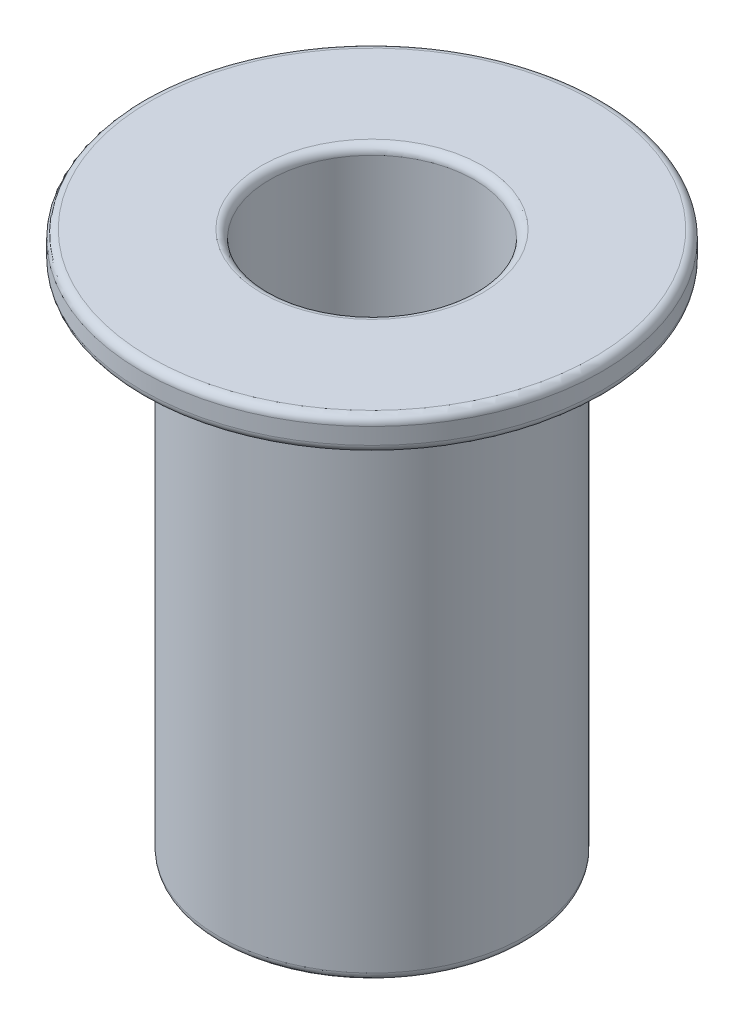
ISO-10303-21;
HEADER;
FILE_DESCRIPTION(('STEP AP214'),'2;1');
FILE_NAME('part.step','',(''),(''),'','','');
FILE_SCHEMA(('AUTOMOTIVE_DESIGN { 1 0 10303 214 1 1 1 1 }'));
ENDSEC;
DATA;
#1=APPLICATION_CONTEXT('core data for automotive mechanical design processes');
#2=APPLICATION_PROTOCOL_DEFINITION('international standard','automotive_design',2000,#1);
#3=PRODUCT_CONTEXT('',#1,'mechanical');
#4=PRODUCT('Part','Part','',(#3));
#5=PRODUCT_RELATED_PRODUCT_CATEGORY('part','',(#4));
#6=PRODUCT_DEFINITION_FORMATION('','',#4);
#7=PRODUCT_DEFINITION_CONTEXT('part definition',#1,'design');
#8=PRODUCT_DEFINITION('design','',#6,#7);
#9=PRODUCT_DEFINITION_SHAPE('','',#8);
#10=(LENGTH_UNIT() NAMED_UNIT(*) SI_UNIT(.MILLI.,.METRE.));
#11=(NAMED_UNIT(*) PLANE_ANGLE_UNIT() SI_UNIT($,.RADIAN.));
#12=(NAMED_UNIT(*) SI_UNIT($,.STERADIAN.) SOLID_ANGLE_UNIT());
#13=UNCERTAINTY_MEASURE_WITH_UNIT(LENGTH_MEASURE(1.E-05),#10,'distance_accuracy_value','');
#14=(GEOMETRIC_REPRESENTATION_CONTEXT(3) GLOBAL_UNCERTAINTY_ASSIGNED_CONTEXT((#13)) GLOBAL_UNIT_ASSIGNED_CONTEXT((#10,
#11,#12)) REPRESENTATION_CONTEXT('',''));
#15=CARTESIAN_POINT('',(0.,0.,0.));
#16=DIRECTION('',(0.,0.,1.));
#17=DIRECTION('',(1.,0.,0.));
#18=AXIS2_PLACEMENT_3D('',#15,#16,#17);
#19=CARTESIAN_POINT('',(0.,-15.875,0.));
#20=DIRECTION('',(0.,-1.,0.));
#21=DIRECTION('',(0.,0.,-1.));
#22=AXIS2_PLACEMENT_3D('',#19,#20,#21);
#23=PLANE('',#22);
#24=CARTESIAN_POINT('',(0.,-15.875,0.));
#25=DIRECTION('',(0.,-1.,0.));
#26=DIRECTION('',(0.,0.,-1.));
#27=AXIS2_PLACEMENT_3D('',#24,#25,#26);
#28=CIRCLE('',#27,4.5085);
#29=CARTESIAN_POINT('',(0.,-15.875,-4.5085));
#30=VERTEX_POINT('',#29);
#31=EDGE_CURVE('E53',#30,#30,#28,.T.);
#32=ORIENTED_EDGE('',*,*,#31,.T.);
#33=EDGE_LOOP('',(#32));
#34=FACE_BOUND('',#33,.T.);
#35=CARTESIAN_POINT('',(0.,-15.875,0.));
#36=DIRECTION('',(0.,-1.,0.));
#37=DIRECTION('',(0.,0.,-1.));
#38=AXIS2_PLACEMENT_3D('',#35,#36,#37);
#39=CIRCLE('',#38,2.41299999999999);
#40=CARTESIAN_POINT('',(0.,-15.875,-2.41299999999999));
#41=VERTEX_POINT('',#40);
#42=EDGE_CURVE('E69',#41,#41,#39,.T.);
#43=ORIENTED_EDGE('',*,*,#42,.F.);
#44=EDGE_LOOP('',(#43));
#45=FACE_BOUND('',#44,.T.);
#46=ADVANCED_FACE('F30',(#34,#45),#23,.T.);
#47=CARTESIAN_POINT('',(0.,0.,0.));
#48=DIRECTION('',(0.,1.,0.));
#49=DIRECTION('',(0.,0.,1.));
#50=AXIS2_PLACEMENT_3D('',#47,#48,#49);
#51=PLANE('',#50);
#52=CARTESIAN_POINT('',(0.,0.,0.));
#53=DIRECTION('',(0.,1.,0.));
#54=DIRECTION('',(0.,0.,1.));
#55=AXIS2_PLACEMENT_3D('',#52,#53,#54);
#56=CIRCLE('',#55,5.0165);
#57=CARTESIAN_POINT('',(0.,0.,5.0165));
#58=VERTEX_POINT('',#57);
#59=EDGE_CURVE('E56',#58,#58,#56,.T.);
#60=ORIENTED_EDGE('',*,*,#59,.T.);
#61=EDGE_LOOP('',(#60));
#62=FACE_BOUND('',#61,.T.);
#63=CARTESIAN_POINT('',(0.,0.,0.));
#64=DIRECTION('',(0.,1.,0.));
#65=DIRECTION('',(0.,0.,1.));
#66=AXIS2_PLACEMENT_3D('',#63,#64,#65);
#67=CIRCLE('',#66,6.88975);
#68=CARTESIAN_POINT('',(0.,0.,6.88975));
#69=VERTEX_POINT('',#68);
#70=EDGE_CURVE('E59',#69,#69,#67,.F.);
#71=ORIENTED_EDGE('',*,*,#70,.T.);
#72=EDGE_LOOP('',(#71));
#73=FACE_BOUND('',#72,.T.);
#74=ADVANCED_FACE('F98',(#62,#73),#51,.F.);
#75=CARTESIAN_POINT('',(0.,1.016,0.));
#76=DIRECTION('',(0.,-1.,0.));
#77=DIRECTION('',(0.,0.,-1.));
#78=AXIS2_PLACEMENT_3D('',#75,#76,#77);
#79=CYLINDRICAL_SURFACE('',#78,7.14375);
#80=CARTESIAN_POINT('',(0.,0.254,0.));
#81=DIRECTION('',(0.,1.,0.));
#82=DIRECTION('',(0.,0.,1.));
#83=AXIS2_PLACEMENT_3D('',#80,#81,#82);
#84=CIRCLE('',#83,7.14375);
#85=CARTESIAN_POINT('',(0.,0.254,7.14375));
#86=VERTEX_POINT('',#85);
#87=EDGE_CURVE('E45',#86,#86,#84,.T.);
#88=ORIENTED_EDGE('',*,*,#87,.T.);
#89=EDGE_LOOP('',(#88));
#90=FACE_BOUND('',#89,.T.);
#91=CARTESIAN_POINT('',(0.,0.762,0.));
#92=DIRECTION('',(0.,1.,0.));
#93=DIRECTION('',(0.,0.,1.));
#94=AXIS2_PLACEMENT_3D('',#91,#92,#93);
#95=CIRCLE('',#94,7.14375);
#96=CARTESIAN_POINT('',(0.,0.762,7.14375));
#97=VERTEX_POINT('',#96);
#98=EDGE_CURVE('E50',#97,#97,#95,.F.);
#99=ORIENTED_EDGE('',*,*,#98,.T.);
#100=EDGE_LOOP('',(#99));
#101=FACE_BOUND('',#100,.T.);
#102=ADVANCED_FACE('F32',(#90,#101),#79,.T.);
#103=CARTESIAN_POINT('',(0.,1.016,0.));
#104=DIRECTION('',(0.,1.,0.));
#105=DIRECTION('',(0.,0.,1.));
#106=AXIS2_PLACEMENT_3D('',#103,#104,#105);
#107=PLANE('',#106);
#108=CARTESIAN_POINT('',(0.,1.016,0.));
#109=DIRECTION('',(0.,1.,0.));
#110=DIRECTION('',(0.,0.,1.));
#111=AXIS2_PLACEMENT_3D('',#108,#109,#110);
#112=CIRCLE('',#111,6.88975);
#113=CARTESIAN_POINT('',(0.,1.016,6.88975));
#114=VERTEX_POINT('',#113);
#115=EDGE_CURVE('E37',#114,#114,#112,.T.);
#116=ORIENTED_EDGE('',*,*,#115,.T.);
#117=EDGE_LOOP('',(#116));
#118=FACE_BOUND('',#117,.T.);
#119=CARTESIAN_POINT('',(0.,1.016,0.));
#120=DIRECTION('',(0.,1.,0.));
#121=DIRECTION('',(0.,0.,1.));
#122=AXIS2_PLACEMENT_3D('',#119,#120,#121);
#123=CIRCLE('',#122,3.429);
#124=CARTESIAN_POINT('',(0.,1.016,3.429));
#125=VERTEX_POINT('',#124);
#126=EDGE_CURVE('E41',#125,#125,#123,.F.);
#127=ORIENTED_EDGE('',*,*,#126,.T.);
#128=EDGE_LOOP('',(#127));
#129=FACE_BOUND('',#128,.T.);
#130=ADVANCED_FACE('F93',(#118,#129),#107,.T.);
#131=CARTESIAN_POINT('',(0.,-15.875,0.));
#132=DIRECTION('',(0.,1.,0.));
#133=DIRECTION('',(0.,0.,1.));
#134=AXIS2_PLACEMENT_3D('',#131,#132,#133);
#135=CYLINDRICAL_SURFACE('',#134,4.7625);
#136=CARTESIAN_POINT('',(0.,-0.254000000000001,0.));
#137=DIRECTION('',(0.,1.,0.));
#138=DIRECTION('',(0.,0.,1.));
#139=AXIS2_PLACEMENT_3D('',#136,#137,#138);
#140=CIRCLE('',#139,4.7625);
#141=CARTESIAN_POINT('',(0.,-0.254000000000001,4.7625));
#142=VERTEX_POINT('',#141);
#143=EDGE_CURVE('E62',#142,#142,#140,.F.);
#144=ORIENTED_EDGE('',*,*,#143,.T.);
#145=EDGE_LOOP('',(#144));
#146=FACE_BOUND('',#145,.T.);
#147=CARTESIAN_POINT('',(0.,-15.621,0.));
#148=DIRECTION('',(0.,-1.,0.));
#149=DIRECTION('',(0.,0.,-1.));
#150=AXIS2_PLACEMENT_3D('',#147,#148,#149);
#151=CIRCLE('',#150,4.7625);
#152=CARTESIAN_POINT('',(0.,-15.621,-4.7625));
#153=VERTEX_POINT('',#152);
#154=EDGE_CURVE('E65',#153,#153,#151,.F.);
#155=ORIENTED_EDGE('',*,*,#154,.T.);
#156=EDGE_LOOP('',(#155));
#157=FACE_BOUND('',#156,.T.);
#158=ADVANCED_FACE('F88',(#146,#157),#135,.T.);
#159=CARTESIAN_POINT('',(0.,-8.509,0.));
#160=DIRECTION('',(0.,1.,0.));
#161=DIRECTION('',(0.,0.,1.));
#162=AXIS2_PLACEMENT_3D('',#159,#160,#161);
#163=CYLINDRICAL_SURFACE('',#162,3.175);
#164=CARTESIAN_POINT('',(0.,0.762000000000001,0.));
#165=DIRECTION('',(0.,1.,0.));
#166=DIRECTION('',(0.,0.,1.));
#167=AXIS2_PLACEMENT_3D('',#164,#165,#166);
#168=CIRCLE('',#167,3.175);
#169=CARTESIAN_POINT('',(0.,0.761999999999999,3.175));
#170=VERTEX_POINT('',#169);
#171=EDGE_CURVE('E10',#170,#170,#168,.T.);
#172=CARTESIAN_POINT('',(0.,-8.509,0.));
#173=DIRECTION('',(0.,1.,0.));
#174=DIRECTION('',(0.,0.,1.));
#175=AXIS2_PLACEMENT_3D('',#172,#173,#174);
#176=CIRCLE('',#175,3.175);
#177=CARTESIAN_POINT('',(0.,-8.509,3.175));
#178=VERTEX_POINT('',#177);
#179=EDGE_CURVE('E68',#178,#178,#176,.T.);
#180=CARTESIAN_POINT('',(0.,0.761999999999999,3.175));
#181=CARTESIAN_POINT('',(0.,0.665427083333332,3.175));
#182=CARTESIAN_POINT('',(0.,0.568854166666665,3.175));
#183=CARTESIAN_POINT('',(0.,0.375708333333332,3.175));
#184=CARTESIAN_POINT('',(0.,0.279135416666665,3.175));
#185=CARTESIAN_POINT('',(0.,0.0859895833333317,3.175));
#186=CARTESIAN_POINT('',(0.,-0.0105833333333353,3.175));
#187=CARTESIAN_POINT('',(0.,-0.203729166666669,3.175));
#188=CARTESIAN_POINT('',(0.,-0.300302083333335,3.175));
#189=CARTESIAN_POINT('',(0.,-0.493447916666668,3.175));
#190=CARTESIAN_POINT('',(0.,-0.590020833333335,3.175));
#191=CARTESIAN_POINT('',(0.,-0.783166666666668,3.175));
#192=CARTESIAN_POINT('',(0.,-0.879739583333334,3.175));
#193=CARTESIAN_POINT('',(0.,-1.07288541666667,3.175));
#194=CARTESIAN_POINT('',(0.,-1.16945833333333,3.175));
#195=CARTESIAN_POINT('',(0.,-1.36260416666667,3.175));
#196=CARTESIAN_POINT('',(0.,-1.45917708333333,3.175));
#197=CARTESIAN_POINT('',(0.,-1.65232291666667,3.175));
#198=CARTESIAN_POINT('',(0.,-1.74889583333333,3.175));
#199=CARTESIAN_POINT('',(0.,-1.94204166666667,3.175));
#200=CARTESIAN_POINT('',(0.,-2.03861458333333,3.175));
#201=CARTESIAN_POINT('',(0.,-2.23176041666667,3.175));
#202=CARTESIAN_POINT('',(0.,-2.32833333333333,3.175));
#203=CARTESIAN_POINT('',(0.,-2.52147916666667,3.175));
#204=CARTESIAN_POINT('',(0.,-2.61805208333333,3.175));
#205=CARTESIAN_POINT('',(0.,-2.81119791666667,3.175));
#206=CARTESIAN_POINT('',(0.,-2.90777083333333,3.175));
#207=CARTESIAN_POINT('',(0.,-3.10091666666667,3.175));
#208=CARTESIAN_POINT('',(0.,-3.19748958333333,3.175));
#209=CARTESIAN_POINT('',(0.,-3.39063541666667,3.175));
#210=CARTESIAN_POINT('',(0.,-3.48720833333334,3.175));
#211=CARTESIAN_POINT('',(0.,-3.68035416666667,3.175));
#212=CARTESIAN_POINT('',(0.,-3.77692708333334,3.175));
#213=CARTESIAN_POINT('',(0.,-3.97007291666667,3.175));
#214=CARTESIAN_POINT('',(0.,-4.06664583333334,3.175));
#215=CARTESIAN_POINT('',(0.,-4.25979166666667,3.175));
#216=CARTESIAN_POINT('',(0.,-4.35636458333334,3.175));
#217=CARTESIAN_POINT('',(0.,-4.54951041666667,3.175));
#218=CARTESIAN_POINT('',(0.,-4.64608333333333,3.175));
#219=CARTESIAN_POINT('',(0.,-4.83922916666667,3.175));
#220=CARTESIAN_POINT('',(0.,-4.93580208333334,3.175));
#221=CARTESIAN_POINT('',(0.,-5.12894791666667,3.175));
#222=CARTESIAN_POINT('',(0.,-5.22552083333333,3.175));
#223=CARTESIAN_POINT('',(0.,-5.41866666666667,3.175));
#224=CARTESIAN_POINT('',(0.,-5.51523958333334,3.175));
#225=CARTESIAN_POINT('',(0.,-5.70838541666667,3.175));
#226=CARTESIAN_POINT('',(0.,-5.80495833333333,3.175));
#227=CARTESIAN_POINT('',(0.,-5.99810416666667,3.175));
#228=CARTESIAN_POINT('',(0.,-6.09467708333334,3.175));
#229=CARTESIAN_POINT('',(0.,-6.28782291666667,3.175));
#230=CARTESIAN_POINT('',(0.,-6.38439583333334,3.175));
#231=CARTESIAN_POINT('',(0.,-6.57754166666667,3.175));
#232=CARTESIAN_POINT('',(0.,-6.67411458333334,3.175));
#233=CARTESIAN_POINT('',(0.,-6.86726041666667,3.175));
#234=CARTESIAN_POINT('',(0.,-6.96383333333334,3.175));
#235=CARTESIAN_POINT('',(0.,-7.15697916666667,3.175));
#236=CARTESIAN_POINT('',(0.,-7.25355208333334,3.175));
#237=CARTESIAN_POINT('',(0.,-7.44669791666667,3.175));
#238=CARTESIAN_POINT('',(0.,-7.54327083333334,3.175));
#239=CARTESIAN_POINT('',(0.,-7.73641666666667,3.175));
#240=CARTESIAN_POINT('',(0.,-7.83298958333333,3.175));
#241=CARTESIAN_POINT('',(0.,-8.02613541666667,3.175));
#242=CARTESIAN_POINT('',(0.,-8.12270833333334,3.175));
#243=CARTESIAN_POINT('',(0.,-8.31585416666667,3.175));
#244=CARTESIAN_POINT('',(0.,-8.41242708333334,3.175));
#245=CARTESIAN_POINT('',(0.,-8.509,3.175));
#246=B_SPLINE_CURVE_WITH_KNOTS('',3,(#180,#181,#182,#183,#184,#185,#186,#187,#188,#189,#190,
#191,#192,#193,#194,#195,#196,#197,#198,#199,#200,#201,#202,#203,#204,#205,#206,#207,#208,#209,
#210,#211,#212,#213,#214,#215,#216,#217,#218,#219,#220,#221,#222,#223,#224,#225,#226,#227,#228,
#229,#230,#231,#232,#233,#234,#235,#236,#237,#238,#239,#240,#241,#242,#243,#244,#245),
.UNSPECIFIED.,.F.,.F.,(4,2,2,2,2,2,2,2,2,2,2,2,2,2,2,2,2,2,2,2,2,2,2,2,2,2,2,2,2,2,2,2,4),(0.,
0.289718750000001,0.5794375,0.869156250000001,1.158875,1.44859375,1.7383125,2.02803125,2.31775,
2.60746875,2.8971875,3.18690625,3.476625,3.76634375,4.0560625,4.34578125,4.6355,4.92521875,
5.2149375,5.50465625,5.794375,6.08409375,6.3738125,6.66353125,6.95325,7.24296875,7.5326875,
7.82240625,8.112125,8.40184375,8.6915625,8.98128125,9.271),.UNSPECIFIED.);
#247=EDGE_CURVE('BSEAM83',#170,#178,#246,.T.);
#248=ORIENTED_EDGE('',*,*,#171,.T.);
#249=ORIENTED_EDGE('',*,*,#179,.F.);
#250=ORIENTED_EDGE('',*,*,#247,.T.);
#251=ORIENTED_EDGE('',*,*,#247,.F.);
#252=EDGE_LOOP('',(#248,#250,#249,#251));
#253=FACE_BOUND('',#252,.T.);
#254=ADVANCED_FACE('F83',(#253),#163,.F.);
#255=CARTESIAN_POINT('',(0.,-8.509,0.));
#256=DIRECTION('',(0.,1.,0.));
#257=DIRECTION('',(0.,0.,1.));
#258=AXIS2_PLACEMENT_3D('',#255,#256,#257);
#259=PLANE('',#258);
#260=CARTESIAN_POINT('',(0.,-8.509,0.));
#261=DIRECTION('',(0.,1.,0.));
#262=DIRECTION('',(0.,0.,1.));
#263=AXIS2_PLACEMENT_3D('',#260,#261,#262);
#264=CIRCLE('',#263,2.41299999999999);
#265=CARTESIAN_POINT('',(0.,-8.509,2.41299999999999));
#266=VERTEX_POINT('',#265);
#267=EDGE_CURVE('E72',#266,#266,#264,.T.);
#268=ORIENTED_EDGE('',*,*,#267,.F.);
#269=EDGE_LOOP('',(#268));
#270=FACE_BOUND('',#269,.T.);
#271=ORIENTED_EDGE('',*,*,#179,.T.);
#272=EDGE_LOOP('',(#271));
#273=FACE_BOUND('',#272,.T.);
#274=ADVANCED_FACE('F80',(#270,#273),#259,.T.);
#275=CARTESIAN_POINT('',(0.,-8.509,0.));
#276=DIRECTION('',(0.,1.,0.));
#277=DIRECTION('',(0.,0.,1.));
#278=AXIS2_PLACEMENT_3D('',#275,#276,#277);
#279=CYLINDRICAL_SURFACE('',#278,2.41299999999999);
#280=ORIENTED_EDGE('',*,*,#42,.T.);
#281=EDGE_LOOP('',(#280));
#282=FACE_BOUND('',#281,.T.);
#283=ORIENTED_EDGE('',*,*,#267,.T.);
#284=EDGE_LOOP('',(#283));
#285=FACE_BOUND('',#284,.T.);
#286=ADVANCED_FACE('F78',(#282,#285),#279,.F.);
#287=CARTESIAN_POINT('',(0.,-0.254000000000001,0.));
#288=DIRECTION('',(0.,1.,0.));
#289=DIRECTION('',(0.,0.,1.));
#290=AXIS2_PLACEMENT_3D('',#287,#288,#289);
#291=TOROIDAL_SURFACE('',#290,5.0165,0.254);
#292=ORIENTED_EDGE('',*,*,#59,.F.);
#293=EDGE_LOOP('',(#292));
#294=FACE_BOUND('',#293,.T.);
#295=ORIENTED_EDGE('',*,*,#143,.F.);
#296=EDGE_LOOP('',(#295));
#297=FACE_BOUND('',#296,.T.);
#298=ADVANCED_FACE('F132',(#294,#297),#291,.F.);
#299=CARTESIAN_POINT('',(0.,-15.621,0.));
#300=DIRECTION('',(0.,-1.,0.));
#301=DIRECTION('',(0.,0.,-1.));
#302=AXIS2_PLACEMENT_3D('',#299,#300,#301);
#303=TOROIDAL_SURFACE('',#302,4.5085,0.254);
#304=ORIENTED_EDGE('',*,*,#154,.F.);
#305=EDGE_LOOP('',(#304));
#306=FACE_BOUND('',#305,.T.);
#307=ORIENTED_EDGE('',*,*,#31,.F.);
#308=EDGE_LOOP('',(#307));
#309=FACE_BOUND('',#308,.T.);
#310=ADVANCED_FACE('F128',(#306,#309),#303,.T.);
#311=CARTESIAN_POINT('',(0.,0.254,0.));
#312=DIRECTION('',(0.,1.,0.));
#313=DIRECTION('',(0.,0.,1.));
#314=AXIS2_PLACEMENT_3D('',#311,#312,#313);
#315=TOROIDAL_SURFACE('',#314,6.88975,0.254);
#316=ORIENTED_EDGE('',*,*,#70,.F.);
#317=EDGE_LOOP('',(#316));
#318=FACE_BOUND('',#317,.T.);
#319=ORIENTED_EDGE('',*,*,#87,.F.);
#320=EDGE_LOOP('',(#319));
#321=FACE_BOUND('',#320,.T.);
#322=ADVANCED_FACE('F122',(#318,#321),#315,.T.);
#323=CARTESIAN_POINT('',(0.,0.762,0.));
#324=DIRECTION('',(0.,1.,0.));
#325=DIRECTION('',(0.,0.,1.));
#326=AXIS2_PLACEMENT_3D('',#323,#324,#325);
#327=TOROIDAL_SURFACE('',#326,6.88975,0.254);
#328=ORIENTED_EDGE('',*,*,#98,.F.);
#329=EDGE_LOOP('',(#328));
#330=FACE_BOUND('',#329,.T.);
#331=ORIENTED_EDGE('',*,*,#115,.F.);
#332=EDGE_LOOP('',(#331));
#333=FACE_BOUND('',#332,.T.);
#334=ADVANCED_FACE('F117',(#330,#333),#327,.T.);
#335=CARTESIAN_POINT('',(0.,0.762000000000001,0.));
#336=DIRECTION('',(0.,1.,0.));
#337=DIRECTION('',(0.,0.,1.));
#338=AXIS2_PLACEMENT_3D('',#335,#336,#337);
#339=TOROIDAL_SURFACE('',#338,3.429,0.254);
#340=ORIENTED_EDGE('',*,*,#126,.F.);
#341=EDGE_LOOP('',(#340));
#342=FACE_BOUND('',#341,.T.);
#343=ORIENTED_EDGE('',*,*,#171,.F.);
#344=EDGE_LOOP('',(#343));
#345=FACE_BOUND('',#344,.T.);
#346=ADVANCED_FACE('F114',(#342,#345),#339,.T.);
#347=CLOSED_SHELL('',(#46,#74,#102,#130,#158,#254,#274,#286,#298,#310,#322,#334,#346));
#348=MANIFOLD_SOLID_BREP('B2',#347);
#349=ADVANCED_BREP_SHAPE_REPRESENTATION('',(#18,#348),#14);
#350=SHAPE_DEFINITION_REPRESENTATION(#9,#349);
ENDSEC;
END-ISO-10303-21;
